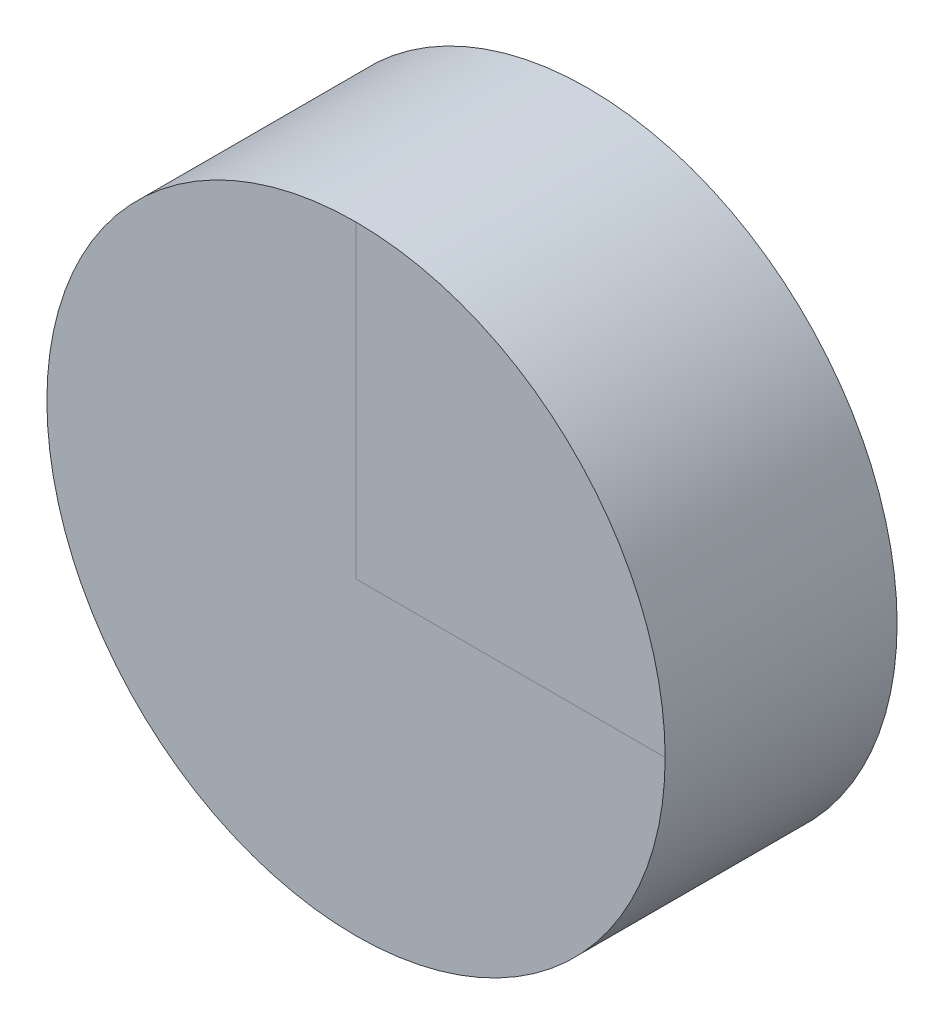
ISO-10303-21;
HEADER;
FILE_DESCRIPTION(('STEP AP214'),'2;1');
FILE_NAME('part.step','',(''),(''),'','','');
FILE_SCHEMA(('AUTOMOTIVE_DESIGN { 1 0 10303 214 1 1 1 1 }'));
ENDSEC;
DATA;
#1=APPLICATION_CONTEXT('core data for automotive mechanical design processes');
#2=APPLICATION_PROTOCOL_DEFINITION('international standard','automotive_design',2000,#1);
#3=PRODUCT_CONTEXT('',#1,'mechanical');
#4=PRODUCT('Part','Part','',(#3));
#5=PRODUCT_RELATED_PRODUCT_CATEGORY('part','',(#4));
#6=PRODUCT_DEFINITION_FORMATION('','',#4);
#7=PRODUCT_DEFINITION_CONTEXT('part definition',#1,'design');
#8=PRODUCT_DEFINITION('design','',#6,#7);
#9=PRODUCT_DEFINITION_SHAPE('','',#8);
#10=(LENGTH_UNIT() NAMED_UNIT(*) SI_UNIT(.MILLI.,.METRE.));
#11=(NAMED_UNIT(*) PLANE_ANGLE_UNIT() SI_UNIT($,.RADIAN.));
#12=(NAMED_UNIT(*) SI_UNIT($,.STERADIAN.) SOLID_ANGLE_UNIT());
#13=UNCERTAINTY_MEASURE_WITH_UNIT(LENGTH_MEASURE(1.E-05),#10,'distance_accuracy_value','');
#14=(GEOMETRIC_REPRESENTATION_CONTEXT(3) GLOBAL_UNCERTAINTY_ASSIGNED_CONTEXT((#13)) GLOBAL_UNIT_ASSIGNED_CONTEXT((#10,
#11,#12)) REPRESENTATION_CONTEXT('',''));
#15=CARTESIAN_POINT('',(0.,0.,0.));
#16=DIRECTION('',(0.,0.,1.));
#17=DIRECTION('',(1.,0.,0.));
#18=AXIS2_PLACEMENT_3D('',#15,#16,#17);
#19=CARTESIAN_POINT('',(0.,0.,0.));
#20=DIRECTION('',(0.,0.,1.));
#21=DIRECTION('',(1.,0.,0.));
#22=AXIS2_PLACEMENT_3D('',#19,#20,#21);
#23=PLANE('',#22);
#24=DIRECTION('',(-1.,0.,0.));
#25=VECTOR('',#24,1.);
#26=CARTESIAN_POINT('',(0.,0.,0.));
#27=LINE('',#26,#25);
#28=CARTESIAN_POINT('',(200.,0.,0.));
#29=VERTEX_POINT('',#28);
#30=CARTESIAN_POINT('',(0.,0.,0.));
#31=VERTEX_POINT('',#30);
#32=EDGE_CURVE('E11',#29,#31,#27,.T.);
#33=ORIENTED_EDGE('',*,*,#32,.F.);
#34=CARTESIAN_POINT('',(0.,0.,0.));
#35=DIRECTION('',(0.,0.,1.));
#36=DIRECTION('',(1.,0.,0.));
#37=AXIS2_PLACEMENT_3D('',#34,#35,#36);
#38=CIRCLE('',#37,200.);
#39=CARTESIAN_POINT('',(0.,200.,0.));
#40=VERTEX_POINT('',#39);
#41=EDGE_CURVE('E91',#40,#29,#38,.T.);
#42=ORIENTED_EDGE('',*,*,#41,.F.);
#43=DIRECTION('',(0.,1.,0.));
#44=VECTOR('',#43,1.);
#45=CARTESIAN_POINT('',(0.,0.,0.));
#46=LINE('',#45,#44);
#47=EDGE_CURVE('E44',#31,#40,#46,.T.);
#48=ORIENTED_EDGE('',*,*,#47,.F.);
#49=EDGE_LOOP('',(#33,#42,#48));
#50=FACE_BOUND('',#49,.T.);
#51=ADVANCED_FACE('F40',(#50),#23,.F.);
#52=CARTESIAN_POINT('',(0.,0.,150.08));
#53=DIRECTION('',(0.,0.,1.));
#54=DIRECTION('',(1.,0.,0.));
#55=AXIS2_PLACEMENT_3D('',#52,#53,#54);
#56=PLANE('',#55);
#57=CARTESIAN_POINT('',(0.,0.,150.08));
#58=DIRECTION('',(0.,0.,1.));
#59=DIRECTION('',(1.,0.,0.));
#60=AXIS2_PLACEMENT_3D('',#57,#58,#59);
#61=CIRCLE('',#60,200.);
#62=CARTESIAN_POINT('',(0.,200.,150.08));
#63=VERTEX_POINT('',#62);
#64=CARTESIAN_POINT('',(200.,0.,150.08));
#65=VERTEX_POINT('',#64);
#66=EDGE_CURVE('E81',#63,#65,#61,.T.);
#67=ORIENTED_EDGE('',*,*,#66,.T.);
#68=DIRECTION('',(-1.,0.,0.));
#69=VECTOR('',#68,1.);
#70=CARTESIAN_POINT('',(0.,0.,150.08));
#71=LINE('',#70,#69);
#72=CARTESIAN_POINT('',(0.,0.,150.08));
#73=VERTEX_POINT('',#72);
#74=EDGE_CURVE('E71',#65,#73,#71,.T.);
#75=ORIENTED_EDGE('',*,*,#74,.T.);
#76=DIRECTION('',(0.,1.,0.));
#77=VECTOR('',#76,1.);
#78=CARTESIAN_POINT('',(0.,0.,150.08));
#79=LINE('',#78,#77);
#80=EDGE_CURVE('E76',#73,#63,#79,.T.);
#81=ORIENTED_EDGE('',*,*,#80,.T.);
#82=EDGE_LOOP('',(#67,#75,#81));
#83=FACE_BOUND('',#82,.T.);
#84=ADVANCED_FACE('F82',(#83),#56,.T.);
#85=CARTESIAN_POINT('',(0.,0.,150.08));
#86=DIRECTION('',(0.,0.,-1.));
#87=DIRECTION('',(-1.,0.,0.));
#88=AXIS2_PLACEMENT_3D('',#85,#86,#87);
#89=CYLINDRICAL_SURFACE('',#88,200.);
#90=EDGE_CURVE('E75',#65,#63,#61,.T.);
#91=ORIENTED_EDGE('',*,*,#90,.F.);
#92=ORIENTED_EDGE('',*,*,#66,.F.);
#93=EDGE_LOOP('',(#91,#92));
#94=FACE_BOUND('',#93,.T.);
#95=EDGE_CURVE('E84',#29,#40,#38,.T.);
#96=ORIENTED_EDGE('',*,*,#95,.T.);
#97=ORIENTED_EDGE('',*,*,#41,.T.);
#98=EDGE_LOOP('',(#96,#97));
#99=FACE_BOUND('',#98,.T.);
#100=ADVANCED_FACE('F42',(#94,#99),#89,.T.);
#101=ORIENTED_EDGE('',*,*,#74,.F.);
#102=ORIENTED_EDGE('',*,*,#90,.T.);
#103=ORIENTED_EDGE('',*,*,#80,.F.);
#104=EDGE_LOOP('',(#101,#102,#103));
#105=FACE_BOUND('',#104,.T.);
#106=ADVANCED_FACE('F73',(#105),#56,.T.);
#107=ORIENTED_EDGE('',*,*,#95,.F.);
#108=ORIENTED_EDGE('',*,*,#32,.T.);
#109=ORIENTED_EDGE('',*,*,#47,.T.);
#110=EDGE_LOOP('',(#107,#108,#109));
#111=FACE_BOUND('',#110,.T.);
#112=ADVANCED_FACE('F94',(#111),#23,.F.);
#113=CLOSED_SHELL('',(#51,#84,#100,#106,#112));
#114=MANIFOLD_SOLID_BREP('B2',#113);
#115=ADVANCED_BREP_SHAPE_REPRESENTATION('',(#18,#114),#14);
#116=SHAPE_DEFINITION_REPRESENTATION(#9,#115);
ENDSEC;
END-ISO-10303-21;
